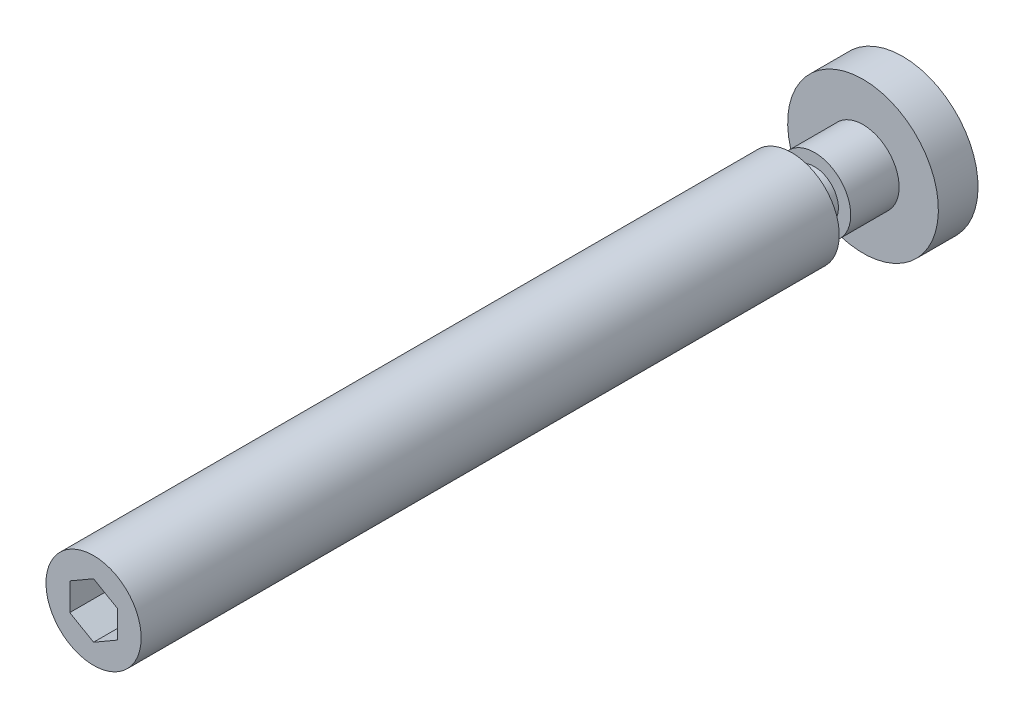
ISO-10303-21;
HEADER;
FILE_DESCRIPTION(('STEP AP214'),'2;1');
FILE_NAME('part.step','',(''),(''),'','','');
FILE_SCHEMA(('AUTOMOTIVE_DESIGN { 1 0 10303 214 1 1 1 1 }'));
ENDSEC;
DATA;
#1=APPLICATION_CONTEXT('core data for automotive mechanical design processes');
#2=APPLICATION_PROTOCOL_DEFINITION('international standard','automotive_design',2000,#1);
#3=PRODUCT_CONTEXT('',#1,'mechanical');
#4=PRODUCT('Part','Part','',(#3));
#5=PRODUCT_RELATED_PRODUCT_CATEGORY('part','',(#4));
#6=PRODUCT_DEFINITION_FORMATION('','',#4);
#7=PRODUCT_DEFINITION_CONTEXT('part definition',#1,'design');
#8=PRODUCT_DEFINITION('design','',#6,#7);
#9=PRODUCT_DEFINITION_SHAPE('','',#8);
#10=(LENGTH_UNIT() NAMED_UNIT(*) SI_UNIT(.MILLI.,.METRE.));
#11=(NAMED_UNIT(*) PLANE_ANGLE_UNIT() SI_UNIT($,.RADIAN.));
#12=(NAMED_UNIT(*) SI_UNIT($,.STERADIAN.) SOLID_ANGLE_UNIT());
#13=UNCERTAINTY_MEASURE_WITH_UNIT(LENGTH_MEASURE(1.E-05),#10,'distance_accuracy_value','');
#14=(GEOMETRIC_REPRESENTATION_CONTEXT(3) GLOBAL_UNCERTAINTY_ASSIGNED_CONTEXT((#13)) GLOBAL_UNIT_ASSIGNED_CONTEXT((#10,
#11,#12)) REPRESENTATION_CONTEXT('',''));
#15=CARTESIAN_POINT('',(0.,0.,0.));
#16=DIRECTION('',(0.,0.,1.));
#17=DIRECTION('',(1.,0.,0.));
#18=AXIS2_PLACEMENT_3D('',#15,#16,#17);
#19=CARTESIAN_POINT('',(0.,0.,0.));
#20=DIRECTION('',(0.,0.,1.));
#21=DIRECTION('',(0.,1.,0.));
#22=AXIS2_PLACEMENT_3D('',#19,#20,#21);
#23=PLANE('',#22);
#24=CARTESIAN_POINT('',(0.,0.,0.));
#25=DIRECTION('',(0.,0.,1.));
#26=DIRECTION('',(0.,1.,0.));
#27=AXIS2_PLACEMENT_3D('',#24,#25,#26);
#28=CIRCLE('',#27,9.5);
#29=CARTESIAN_POINT('',(0.,9.5,0.));
#30=VERTEX_POINT('',#29);
#31=EDGE_CURVE('E9',#30,#30,#28,.T.);
#32=ORIENTED_EDGE('',*,*,#31,.F.);
#33=EDGE_LOOP('',(#32));
#34=FACE_BOUND('',#33,.T.);
#35=ADVANCED_FACE('F14',(#34),#23,.F.);
#36=CARTESIAN_POINT('',(0.,0.,40.));
#37=DIRECTION('',(0.,0.,1.));
#38=DIRECTION('',(0.,1.,0.));
#39=AXIS2_PLACEMENT_3D('',#36,#37,#38);
#40=CYLINDRICAL_SURFACE('',#39,9.5);
#41=CARTESIAN_POINT('',(0.,0.,5.));
#42=DIRECTION('',(0.,0.,1.));
#43=DIRECTION('',(0.,1.,0.));
#44=AXIS2_PLACEMENT_3D('',#41,#42,#43);
#45=CIRCLE('',#44,9.5);
#46=CARTESIAN_POINT('',(0.,9.5,5.));
#47=VERTEX_POINT('',#46);
#48=EDGE_CURVE('E21',#47,#47,#45,.T.);
#49=ORIENTED_EDGE('',*,*,#48,.F.);
#50=EDGE_LOOP('',(#49));
#51=FACE_BOUND('',#50,.T.);
#52=ORIENTED_EDGE('',*,*,#31,.T.);
#53=EDGE_LOOP('',(#52));
#54=FACE_BOUND('',#53,.T.);
#55=ADVANCED_FACE('F142',(#51,#54),#40,.T.);
#56=CARTESIAN_POINT('',(0.,-9.5,5.));
#57=DIRECTION('',(0.,0.,-1.));
#58=DIRECTION('',(0.,-1.,0.));
#59=AXIS2_PLACEMENT_3D('',#56,#57,#58);
#60=PLANE('',#59);
#61=CARTESIAN_POINT('',(0.,0.,5.));
#62=DIRECTION('',(0.,0.,1.));
#63=DIRECTION('',(0.,1.,0.));
#64=AXIS2_PLACEMENT_3D('',#61,#62,#63);
#65=CIRCLE('',#64,4.55);
#66=CARTESIAN_POINT('',(0.,4.55,5.));
#67=VERTEX_POINT('',#66);
#68=EDGE_CURVE('E135',#67,#67,#65,.T.);
#69=ORIENTED_EDGE('',*,*,#68,.F.);
#70=EDGE_LOOP('',(#69));
#71=FACE_BOUND('',#70,.T.);
#72=ORIENTED_EDGE('',*,*,#48,.T.);
#73=EDGE_LOOP('',(#72));
#74=FACE_BOUND('',#73,.T.);
#75=ADVANCED_FACE('F140',(#71,#74),#60,.F.);
#76=CARTESIAN_POINT('',(0.,0.,40.));
#77=DIRECTION('',(0.,0.,1.));
#78=DIRECTION('',(0.,1.,0.));
#79=AXIS2_PLACEMENT_3D('',#76,#77,#78);
#80=CYLINDRICAL_SURFACE('',#79,4.55);
#81=CARTESIAN_POINT('',(0.,0.,11.1));
#82=DIRECTION('',(0.,0.,1.));
#83=DIRECTION('',(0.,1.,0.));
#84=AXIS2_PLACEMENT_3D('',#81,#82,#83);
#85=CIRCLE('',#84,4.55);
#86=CARTESIAN_POINT('',(0.,4.55,11.1));
#87=VERTEX_POINT('',#86);
#88=EDGE_CURVE('E132',#87,#87,#85,.T.);
#89=ORIENTED_EDGE('',*,*,#88,.F.);
#90=EDGE_LOOP('',(#89));
#91=FACE_BOUND('',#90,.T.);
#92=ORIENTED_EDGE('',*,*,#68,.T.);
#93=EDGE_LOOP('',(#92));
#94=FACE_BOUND('',#93,.T.);
#95=ADVANCED_FACE('F165',(#91,#94),#80,.T.);
#96=CARTESIAN_POINT('',(0.,-4.55,11.1));
#97=DIRECTION('',(0.,0.,-1.));
#98=DIRECTION('',(0.,-1.,0.));
#99=AXIS2_PLACEMENT_3D('',#96,#97,#98);
#100=PLANE('',#99);
#101=CARTESIAN_POINT('',(0.,0.,11.1));
#102=DIRECTION('',(0.,0.,1.));
#103=DIRECTION('',(0.,1.,0.));
#104=AXIS2_PLACEMENT_3D('',#101,#102,#103);
#105=CIRCLE('',#104,3.);
#106=CARTESIAN_POINT('',(0.,3.,11.1));
#107=VERTEX_POINT('',#106);
#108=EDGE_CURVE('E129',#107,#107,#105,.T.);
#109=ORIENTED_EDGE('',*,*,#108,.F.);
#110=EDGE_LOOP('',(#109));
#111=FACE_BOUND('',#110,.T.);
#112=ORIENTED_EDGE('',*,*,#88,.T.);
#113=EDGE_LOOP('',(#112));
#114=FACE_BOUND('',#113,.T.);
#115=ADVANCED_FACE('F174',(#111,#114),#100,.F.);
#116=CARTESIAN_POINT('',(0.,0.,40.));
#117=DIRECTION('',(0.,0.,1.));
#118=DIRECTION('',(0.,1.,0.));
#119=AXIS2_PLACEMENT_3D('',#116,#117,#118);
#120=CYLINDRICAL_SURFACE('',#119,3.);
#121=CARTESIAN_POINT('',(0.,0.,14.));
#122=DIRECTION('',(0.,0.,1.));
#123=DIRECTION('',(0.,1.,0.));
#124=AXIS2_PLACEMENT_3D('',#121,#122,#123);
#125=CIRCLE('',#124,3.);
#126=CARTESIAN_POINT('',(0.,3.,14.));
#127=VERTEX_POINT('',#126);
#128=EDGE_CURVE('E126',#127,#127,#125,.T.);
#129=ORIENTED_EDGE('',*,*,#128,.F.);
#130=EDGE_LOOP('',(#129));
#131=FACE_BOUND('',#130,.T.);
#132=ORIENTED_EDGE('',*,*,#108,.T.);
#133=EDGE_LOOP('',(#132));
#134=FACE_BOUND('',#133,.T.);
#135=ADVANCED_FACE('F183',(#131,#134),#120,.T.);
#136=CARTESIAN_POINT('',(0.,-3.,14.));
#137=DIRECTION('',(0.,0.,1.));
#138=DIRECTION('',(0.,1.,0.));
#139=AXIS2_PLACEMENT_3D('',#136,#137,#138);
#140=PLANE('',#139);
#141=CARTESIAN_POINT('',(0.,0.,14.));
#142=DIRECTION('',(0.,0.,1.));
#143=DIRECTION('',(0.,1.,0.));
#144=AXIS2_PLACEMENT_3D('',#141,#142,#143);
#145=CIRCLE('',#144,6.);
#146=CARTESIAN_POINT('',(0.,6.,14.));
#147=VERTEX_POINT('',#146);
#148=EDGE_CURVE('E123',#147,#147,#145,.T.);
#149=ORIENTED_EDGE('',*,*,#148,.F.);
#150=EDGE_LOOP('',(#149));
#151=FACE_BOUND('',#150,.T.);
#152=ORIENTED_EDGE('',*,*,#128,.T.);
#153=EDGE_LOOP('',(#152));
#154=FACE_BOUND('',#153,.T.);
#155=ADVANCED_FACE('F192',(#151,#154),#140,.F.);
#156=CARTESIAN_POINT('',(0.,0.,40.));
#157=DIRECTION('',(0.,0.,1.));
#158=DIRECTION('',(0.,1.,0.));
#159=AXIS2_PLACEMENT_3D('',#156,#157,#158);
#160=CYLINDRICAL_SURFACE('',#159,6.);
#161=CARTESIAN_POINT('',(0.,0.,102.));
#162=DIRECTION('',(0.,0.,1.));
#163=DIRECTION('',(0.,1.,0.));
#164=AXIS2_PLACEMENT_3D('',#161,#162,#163);
#165=CIRCLE('',#164,6.);
#166=CARTESIAN_POINT('',(0.,6.,102.));
#167=VERTEX_POINT('',#166);
#168=EDGE_CURVE('E115',#167,#167,#165,.T.);
#169=ORIENTED_EDGE('',*,*,#168,.F.);
#170=EDGE_LOOP('',(#169));
#171=FACE_BOUND('',#170,.T.);
#172=ORIENTED_EDGE('',*,*,#148,.T.);
#173=EDGE_LOOP('',(#172));
#174=FACE_BOUND('',#173,.T.);
#175=ADVANCED_FACE('F201',(#171,#174),#160,.T.);
#176=CARTESIAN_POINT('',(0.,-6.,102.));
#177=DIRECTION('',(0.,0.,-1.));
#178=DIRECTION('',(0.,-1.,0.));
#179=AXIS2_PLACEMENT_3D('',#176,#177,#178);
#180=PLANE('',#179);
#181=DIRECTION('',(-0.866025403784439,-0.5,0.));
#182=VECTOR('',#181,1.);
#183=CARTESIAN_POINT('',(0.,3.46410161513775,102.));
#184=LINE('',#183,#182);
#185=CARTESIAN_POINT('',(0.,3.46410161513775,102.));
#186=VERTEX_POINT('',#185);
#187=CARTESIAN_POINT('',(-3.,1.73205080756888,102.));
#188=VERTEX_POINT('',#187);
#189=EDGE_CURVE('E102',#186,#188,#184,.T.);
#190=ORIENTED_EDGE('',*,*,#189,.F.);
#191=DIRECTION('',(-0.866025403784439,0.5,0.));
#192=VECTOR('',#191,1.);
#193=CARTESIAN_POINT('',(3.,1.73205080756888,102.));
#194=LINE('',#193,#192);
#195=CARTESIAN_POINT('',(3.,1.73205080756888,102.));
#196=VERTEX_POINT('',#195);
#197=EDGE_CURVE('E28',#196,#186,#194,.T.);
#198=ORIENTED_EDGE('',*,*,#197,.F.);
#199=DIRECTION('',(0.,1.,0.));
#200=VECTOR('',#199,1.);
#201=CARTESIAN_POINT('',(3.,-1.73205080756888,102.));
#202=LINE('',#201,#200);
#203=CARTESIAN_POINT('',(3.,-1.73205080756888,102.));
#204=VERTEX_POINT('',#203);
#205=EDGE_CURVE('E111',#204,#196,#202,.T.);
#206=ORIENTED_EDGE('',*,*,#205,.F.);
#207=DIRECTION('',(0.866025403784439,0.5,0.));
#208=VECTOR('',#207,1.);
#209=CARTESIAN_POINT('',(0.,-3.46410161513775,102.));
#210=LINE('',#209,#208);
#211=CARTESIAN_POINT('',(0.,-3.46410161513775,102.));
#212=VERTEX_POINT('',#211);
#213=EDGE_CURVE('E109',#212,#204,#210,.T.);
#214=ORIENTED_EDGE('',*,*,#213,.F.);
#215=DIRECTION('',(0.866025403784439,-0.5,0.));
#216=VECTOR('',#215,1.);
#217=CARTESIAN_POINT('',(-3.,-1.73205080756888,102.));
#218=LINE('',#217,#216);
#219=CARTESIAN_POINT('',(-3.,-1.73205080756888,102.));
#220=VERTEX_POINT('',#219);
#221=EDGE_CURVE('E76',#220,#212,#218,.T.);
#222=ORIENTED_EDGE('',*,*,#221,.F.);
#223=DIRECTION('',(0.,-1.,0.));
#224=VECTOR('',#223,1.);
#225=CARTESIAN_POINT('',(-3.,1.73205080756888,102.));
#226=LINE('',#225,#224);
#227=EDGE_CURVE('E105',#188,#220,#226,.T.);
#228=ORIENTED_EDGE('',*,*,#227,.F.);
#229=EDGE_LOOP('',(#190,#198,#206,#214,#222,#228));
#230=FACE_BOUND('',#229,.T.);
#231=ORIENTED_EDGE('',*,*,#168,.T.);
#232=EDGE_LOOP('',(#231));
#233=FACE_BOUND('',#232,.T.);
#234=ADVANCED_FACE('F210',(#230,#233),#180,.F.);
#235=CARTESIAN_POINT('',(3.,1.73205080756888,94.));
#236=DIRECTION('',(0.5,0.866025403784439,0.));
#237=DIRECTION('',(-0.866025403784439,0.5,0.));
#238=AXIS2_PLACEMENT_3D('',#235,#236,#237);
#239=PLANE('',#238);
#240=ORIENTED_EDGE('',*,*,#197,.T.);
#241=DIRECTION('',(0.,0.,1.));
#242=VECTOR('',#241,1.);
#243=CARTESIAN_POINT('',(0.,3.46410161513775,94.));
#244=LINE('',#243,#242);
#245=CARTESIAN_POINT('',(0.,3.46410161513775,94.));
#246=VERTEX_POINT('',#245);
#247=EDGE_CURVE('E58',#246,#186,#244,.T.);
#248=ORIENTED_EDGE('',*,*,#247,.F.);
#249=DIRECTION('',(-0.866025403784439,0.5,0.));
#250=VECTOR('',#249,1.);
#251=CARTESIAN_POINT('',(3.,1.73205080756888,94.));
#252=LINE('',#251,#250);
#253=CARTESIAN_POINT('',(3.,1.73205080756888,94.));
#254=VERTEX_POINT('',#253);
#255=EDGE_CURVE('E113',#254,#246,#252,.T.);
#256=ORIENTED_EDGE('',*,*,#255,.F.);
#257=DIRECTION('',(0.,0.,1.));
#258=VECTOR('',#257,1.);
#259=CARTESIAN_POINT('',(3.,1.73205080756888,94.));
#260=LINE('',#259,#258);
#261=EDGE_CURVE('E36',#254,#196,#260,.T.);
#262=ORIENTED_EDGE('',*,*,#261,.T.);
#263=EDGE_LOOP('',(#240,#248,#256,#262));
#264=FACE_BOUND('',#263,.T.);
#265=ADVANCED_FACE('F219',(#264),#239,.F.);
#266=CARTESIAN_POINT('',(3.,-1.73205080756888,94.));
#267=DIRECTION('',(1.,0.,0.));
#268=DIRECTION('',(0.,1.,0.));
#269=AXIS2_PLACEMENT_3D('',#266,#267,#268);
#270=PLANE('',#269);
#271=ORIENTED_EDGE('',*,*,#205,.T.);
#272=ORIENTED_EDGE('',*,*,#261,.F.);
#273=DIRECTION('',(0.,1.,0.));
#274=VECTOR('',#273,1.);
#275=CARTESIAN_POINT('',(3.,-1.73205080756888,94.));
#276=LINE('',#275,#274);
#277=CARTESIAN_POINT('',(3.,-1.73205080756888,94.));
#278=VERTEX_POINT('',#277);
#279=EDGE_CURVE('E88',#278,#254,#276,.T.);
#280=ORIENTED_EDGE('',*,*,#279,.F.);
#281=DIRECTION('',(0.,0.,1.));
#282=VECTOR('',#281,1.);
#283=CARTESIAN_POINT('',(3.,-1.73205080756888,94.));
#284=LINE('',#283,#282);
#285=EDGE_CURVE('E80',#278,#204,#284,.T.);
#286=ORIENTED_EDGE('',*,*,#285,.T.);
#287=EDGE_LOOP('',(#271,#272,#280,#286));
#288=FACE_BOUND('',#287,.T.);
#289=ADVANCED_FACE('F228',(#288),#270,.F.);
#290=CARTESIAN_POINT('',(0.,-3.46410161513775,94.));
#291=DIRECTION('',(0.5,-0.866025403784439,0.));
#292=DIRECTION('',(0.866025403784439,0.5,0.));
#293=AXIS2_PLACEMENT_3D('',#290,#291,#292);
#294=PLANE('',#293);
#295=ORIENTED_EDGE('',*,*,#213,.T.);
#296=ORIENTED_EDGE('',*,*,#285,.F.);
#297=DIRECTION('',(0.866025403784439,0.5,0.));
#298=VECTOR('',#297,1.);
#299=CARTESIAN_POINT('',(0.,-3.46410161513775,94.));
#300=LINE('',#299,#298);
#301=CARTESIAN_POINT('',(0.,-3.46410161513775,94.));
#302=VERTEX_POINT('',#301);
#303=EDGE_CURVE('E84',#302,#278,#300,.T.);
#304=ORIENTED_EDGE('',*,*,#303,.F.);
#305=DIRECTION('',(0.,0.,1.));
#306=VECTOR('',#305,1.);
#307=CARTESIAN_POINT('',(0.,-3.46410161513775,94.));
#308=LINE('',#307,#306);
#309=EDGE_CURVE('E69',#302,#212,#308,.T.);
#310=ORIENTED_EDGE('',*,*,#309,.T.);
#311=EDGE_LOOP('',(#295,#296,#304,#310));
#312=FACE_BOUND('',#311,.T.);
#313=ADVANCED_FACE('F85',(#312),#294,.F.);
#314=CARTESIAN_POINT('',(-3.,-1.73205080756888,94.));
#315=DIRECTION('',(-0.5,-0.866025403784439,0.));
#316=DIRECTION('',(0.866025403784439,-0.5,0.));
#317=AXIS2_PLACEMENT_3D('',#314,#315,#316);
#318=PLANE('',#317);
#319=ORIENTED_EDGE('',*,*,#221,.T.);
#320=ORIENTED_EDGE('',*,*,#309,.F.);
#321=DIRECTION('',(0.866025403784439,-0.5,0.));
#322=VECTOR('',#321,1.);
#323=CARTESIAN_POINT('',(-3.,-1.73205080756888,94.));
#324=LINE('',#323,#322);
#325=CARTESIAN_POINT('',(-3.,-1.73205080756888,94.));
#326=VERTEX_POINT('',#325);
#327=EDGE_CURVE('E73',#326,#302,#324,.T.);
#328=ORIENTED_EDGE('',*,*,#327,.F.);
#329=DIRECTION('',(0.,0.,1.));
#330=VECTOR('',#329,1.);
#331=CARTESIAN_POINT('',(-3.,-1.73205080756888,94.));
#332=LINE('',#331,#330);
#333=EDGE_CURVE('E81',#326,#220,#332,.T.);
#334=ORIENTED_EDGE('',*,*,#333,.T.);
#335=EDGE_LOOP('',(#319,#320,#328,#334));
#336=FACE_BOUND('',#335,.T.);
#337=ADVANCED_FACE('F71',(#336),#318,.F.);
#338=CARTESIAN_POINT('',(-3.,1.73205080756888,94.));
#339=DIRECTION('',(-1.,0.,0.));
#340=DIRECTION('',(0.,-1.,0.));
#341=AXIS2_PLACEMENT_3D('',#338,#339,#340);
#342=PLANE('',#341);
#343=ORIENTED_EDGE('',*,*,#227,.T.);
#344=ORIENTED_EDGE('',*,*,#333,.F.);
#345=DIRECTION('',(0.,-1.,0.));
#346=VECTOR('',#345,1.);
#347=CARTESIAN_POINT('',(-3.,1.73205080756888,94.));
#348=LINE('',#347,#346);
#349=CARTESIAN_POINT('',(-3.,1.73205080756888,94.));
#350=VERTEX_POINT('',#349);
#351=EDGE_CURVE('E94',#350,#326,#348,.T.);
#352=ORIENTED_EDGE('',*,*,#351,.F.);
#353=DIRECTION('',(0.,0.,1.));
#354=VECTOR('',#353,1.);
#355=CARTESIAN_POINT('',(-3.,1.73205080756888,94.));
#356=LINE('',#355,#354);
#357=EDGE_CURVE('E118',#350,#188,#356,.T.);
#358=ORIENTED_EDGE('',*,*,#357,.T.);
#359=EDGE_LOOP('',(#343,#344,#352,#358));
#360=FACE_BOUND('',#359,.T.);
#361=ADVANCED_FACE('F250',(#360),#342,.F.);
#362=CARTESIAN_POINT('',(0.,3.46410161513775,94.));
#363=DIRECTION('',(-0.5,0.866025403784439,0.));
#364=DIRECTION('',(-0.866025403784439,-0.5,0.));
#365=AXIS2_PLACEMENT_3D('',#362,#363,#364);
#366=PLANE('',#365);
#367=ORIENTED_EDGE('',*,*,#189,.T.);
#368=ORIENTED_EDGE('',*,*,#357,.F.);
#369=DIRECTION('',(-0.866025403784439,-0.5,0.));
#370=VECTOR('',#369,1.);
#371=CARTESIAN_POINT('',(0.,3.46410161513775,94.));
#372=LINE('',#371,#370);
#373=EDGE_CURVE('E96',#246,#350,#372,.T.);
#374=ORIENTED_EDGE('',*,*,#373,.F.);
#375=ORIENTED_EDGE('',*,*,#247,.T.);
#376=EDGE_LOOP('',(#367,#368,#374,#375));
#377=FACE_BOUND('',#376,.T.);
#378=ADVANCED_FACE('F258',(#377),#366,.F.);
#379=CARTESIAN_POINT('',(0.,3.46410161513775,94.));
#380=DIRECTION('',(0.,0.,1.));
#381=DIRECTION('',(1.,0.,0.));
#382=AXIS2_PLACEMENT_3D('',#379,#380,#381);
#383=PLANE('',#382);
#384=ORIENTED_EDGE('',*,*,#255,.T.);
#385=ORIENTED_EDGE('',*,*,#373,.T.);
#386=ORIENTED_EDGE('',*,*,#351,.T.);
#387=ORIENTED_EDGE('',*,*,#327,.T.);
#388=ORIENTED_EDGE('',*,*,#303,.T.);
#389=ORIENTED_EDGE('',*,*,#279,.T.);
#390=EDGE_LOOP('',(#384,#385,#386,#387,#388,#389));
#391=FACE_BOUND('',#390,.T.);
#392=ADVANCED_FACE('F91',(#391),#383,.T.);
#393=CLOSED_SHELL('',(#35,#55,#75,#95,#115,#135,#155,#175,#234,#265,#289,#313,#337,#361,#378,#392));
#394=MANIFOLD_SOLID_BREP('B1',#393);
#395=ADVANCED_BREP_SHAPE_REPRESENTATION('',(#18,#394),#14);
#396=SHAPE_DEFINITION_REPRESENTATION(#9,#395);
ENDSEC;
END-ISO-10303-21;
